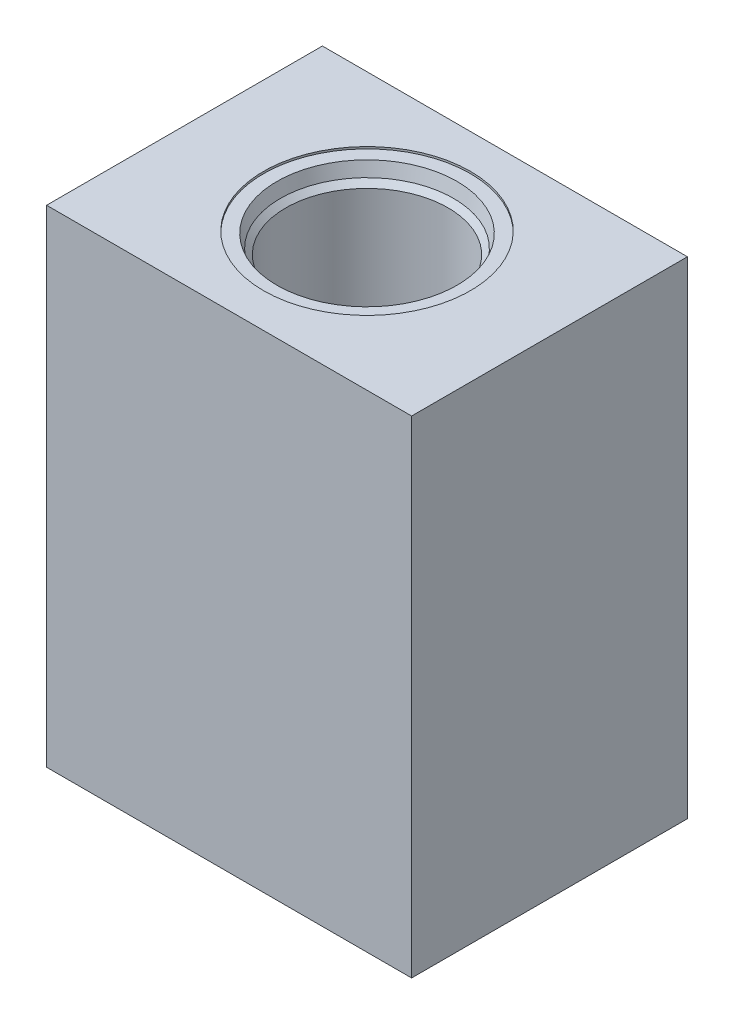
ISO-10303-21;
HEADER;
FILE_DESCRIPTION(('STEP AP214'),'2;1');
FILE_NAME('part.step','',(''),(''),'','','');
FILE_SCHEMA(('AUTOMOTIVE_DESIGN { 1 0 10303 214 1 1 1 1 }'));
ENDSEC;
DATA;
#1=APPLICATION_CONTEXT('core data for automotive mechanical design processes');
#2=APPLICATION_PROTOCOL_DEFINITION('international standard','automotive_design',2000,#1);
#3=PRODUCT_CONTEXT('',#1,'mechanical');
#4=PRODUCT('Part','Part','',(#3));
#5=PRODUCT_RELATED_PRODUCT_CATEGORY('part','',(#4));
#6=PRODUCT_DEFINITION_FORMATION('','',#4);
#7=PRODUCT_DEFINITION_CONTEXT('part definition',#1,'design');
#8=PRODUCT_DEFINITION('design','',#6,#7);
#9=PRODUCT_DEFINITION_SHAPE('','',#8);
#10=(LENGTH_UNIT() NAMED_UNIT(*) SI_UNIT(.MILLI.,.METRE.));
#11=(NAMED_UNIT(*) PLANE_ANGLE_UNIT() SI_UNIT($,.RADIAN.));
#12=(NAMED_UNIT(*) SI_UNIT($,.STERADIAN.) SOLID_ANGLE_UNIT());
#13=UNCERTAINTY_MEASURE_WITH_UNIT(LENGTH_MEASURE(1.E-05),#10,'distance_accuracy_value','');
#14=(GEOMETRIC_REPRESENTATION_CONTEXT(3) GLOBAL_UNCERTAINTY_ASSIGNED_CONTEXT((#13)) GLOBAL_UNIT_ASSIGNED_CONTEXT((#10,
#11,#12)) REPRESENTATION_CONTEXT('',''));
#15=CARTESIAN_POINT('',(0.,0.,0.));
#16=DIRECTION('',(0.,0.,1.));
#17=DIRECTION('',(1.,0.,0.));
#18=AXIS2_PLACEMENT_3D('',#15,#16,#17);
#19=CARTESIAN_POINT('',(-45.,-120.,-34.));
#20=DIRECTION('',(-1.,0.,0.));
#21=DIRECTION('',(0.,0.,1.));
#22=AXIS2_PLACEMENT_3D('',#19,#20,#21);
#23=PLANE('',#22);
#24=DIRECTION('',(0.,0.,1.));
#25=VECTOR('',#24,1.);
#26=CARTESIAN_POINT('',(-45.,0.,-34.));
#27=LINE('',#26,#25);
#28=CARTESIAN_POINT('',(-45.,0.,-34.));
#29=VERTEX_POINT('',#28);
#30=CARTESIAN_POINT('',(-45.,0.,34.));
#31=VERTEX_POINT('',#30);
#32=EDGE_CURVE('E120',#29,#31,#27,.T.);
#33=ORIENTED_EDGE('',*,*,#32,.F.);
#34=DIRECTION('',(0.,1.,0.));
#35=VECTOR('',#34,1.);
#36=CARTESIAN_POINT('',(-45.,-120.,-34.));
#37=LINE('',#36,#35);
#38=CARTESIAN_POINT('',(-45.,-120.,-34.));
#39=VERTEX_POINT('',#38);
#40=EDGE_CURVE('E11',#39,#29,#37,.T.);
#41=ORIENTED_EDGE('',*,*,#40,.F.);
#42=DIRECTION('',(0.,0.,1.));
#43=VECTOR('',#42,1.);
#44=CARTESIAN_POINT('',(-45.,-120.,-34.));
#45=LINE('',#44,#43);
#46=CARTESIAN_POINT('',(-45.,-120.,34.));
#47=VERTEX_POINT('',#46);
#48=EDGE_CURVE('E121',#39,#47,#45,.T.);
#49=ORIENTED_EDGE('',*,*,#48,.T.);
#50=DIRECTION('',(0.,1.,0.));
#51=VECTOR('',#50,1.);
#52=CARTESIAN_POINT('',(-45.,-120.,34.));
#53=LINE('',#52,#51);
#54=EDGE_CURVE('E36',#47,#31,#53,.T.);
#55=ORIENTED_EDGE('',*,*,#54,.T.);
#56=EDGE_LOOP('',(#33,#41,#49,#55));
#57=FACE_BOUND('',#56,.T.);
#58=ADVANCED_FACE('F33',(#57),#23,.T.);
#59=CARTESIAN_POINT('',(-45.,-120.,-34.));
#60=DIRECTION('',(0.,0.,-1.));
#61=DIRECTION('',(-1.,0.,0.));
#62=AXIS2_PLACEMENT_3D('',#59,#60,#61);
#63=PLANE('',#62);
#64=DIRECTION('',(-1.,0.,0.));
#65=VECTOR('',#64,1.);
#66=CARTESIAN_POINT('',(-45.,0.,-34.));
#67=LINE('',#66,#65);
#68=CARTESIAN_POINT('',(45.,0.,-34.));
#69=VERTEX_POINT('',#68);
#70=EDGE_CURVE('E124',#69,#29,#67,.T.);
#71=ORIENTED_EDGE('',*,*,#70,.F.);
#72=DIRECTION('',(0.,1.,0.));
#73=VECTOR('',#72,1.);
#74=CARTESIAN_POINT('',(45.,-120.,-34.));
#75=LINE('',#74,#73);
#76=CARTESIAN_POINT('',(45.,-120.,-34.));
#77=VERTEX_POINT('',#76);
#78=EDGE_CURVE('E42',#77,#69,#75,.T.);
#79=ORIENTED_EDGE('',*,*,#78,.F.);
#80=DIRECTION('',(-1.,0.,0.));
#81=VECTOR('',#80,1.);
#82=CARTESIAN_POINT('',(-45.,-120.,-34.));
#83=LINE('',#82,#81);
#84=EDGE_CURVE('E128',#77,#39,#83,.T.);
#85=ORIENTED_EDGE('',*,*,#84,.T.);
#86=ORIENTED_EDGE('',*,*,#40,.T.);
#87=EDGE_LOOP('',(#71,#79,#85,#86));
#88=FACE_BOUND('',#87,.T.);
#89=ADVANCED_FACE('F143',(#88),#63,.T.);
#90=CARTESIAN_POINT('',(45.,-120.,-34.));
#91=DIRECTION('',(1.,0.,0.));
#92=DIRECTION('',(0.,0.,-1.));
#93=AXIS2_PLACEMENT_3D('',#90,#91,#92);
#94=PLANE('',#93);
#95=DIRECTION('',(0.,0.,-1.));
#96=VECTOR('',#95,1.);
#97=CARTESIAN_POINT('',(45.,0.,-34.));
#98=LINE('',#97,#96);
#99=CARTESIAN_POINT('',(45.,0.,34.));
#100=VERTEX_POINT('',#99);
#101=EDGE_CURVE('E135',#100,#69,#98,.T.);
#102=ORIENTED_EDGE('',*,*,#101,.F.);
#103=DIRECTION('',(0.,1.,0.));
#104=VECTOR('',#103,1.);
#105=CARTESIAN_POINT('',(45.,-120.,34.));
#106=LINE('',#105,#104);
#107=CARTESIAN_POINT('',(45.,-120.,34.));
#108=VERTEX_POINT('',#107);
#109=EDGE_CURVE('E139',#108,#100,#106,.T.);
#110=ORIENTED_EDGE('',*,*,#109,.F.);
#111=DIRECTION('',(0.,0.,-1.));
#112=VECTOR('',#111,1.);
#113=CARTESIAN_POINT('',(45.,-120.,-34.));
#114=LINE('',#113,#112);
#115=EDGE_CURVE('E126',#108,#77,#114,.T.);
#116=ORIENTED_EDGE('',*,*,#115,.T.);
#117=ORIENTED_EDGE('',*,*,#78,.T.);
#118=EDGE_LOOP('',(#102,#110,#116,#117));
#119=FACE_BOUND('',#118,.T.);
#120=ADVANCED_FACE('F146',(#119),#94,.T.);
#121=CARTESIAN_POINT('',(-45.,-120.,34.));
#122=DIRECTION('',(0.,0.,1.));
#123=DIRECTION('',(1.,0.,0.));
#124=AXIS2_PLACEMENT_3D('',#121,#122,#123);
#125=PLANE('',#124);
#126=DIRECTION('',(1.,0.,0.));
#127=VECTOR('',#126,1.);
#128=CARTESIAN_POINT('',(-45.,0.,34.));
#129=LINE('',#128,#127);
#130=EDGE_CURVE('E132',#31,#100,#129,.T.);
#131=ORIENTED_EDGE('',*,*,#130,.F.);
#132=ORIENTED_EDGE('',*,*,#54,.F.);
#133=DIRECTION('',(1.,0.,0.));
#134=VECTOR('',#133,1.);
#135=CARTESIAN_POINT('',(-45.,-120.,34.));
#136=LINE('',#135,#134);
#137=EDGE_CURVE('E123',#47,#108,#136,.T.);
#138=ORIENTED_EDGE('',*,*,#137,.T.);
#139=ORIENTED_EDGE('',*,*,#109,.T.);
#140=EDGE_LOOP('',(#131,#132,#138,#139));
#141=FACE_BOUND('',#140,.T.);
#142=ADVANCED_FACE('F140',(#141),#125,.T.);
#143=CARTESIAN_POINT('',(-45.,-120.,34.));
#144=DIRECTION('',(0.,1.,0.));
#145=DIRECTION('',(0.,0.,1.));
#146=AXIS2_PLACEMENT_3D('',#143,#144,#145);
#147=PLANE('',#146);
#148=ORIENTED_EDGE('',*,*,#48,.F.);
#149=ORIENTED_EDGE('',*,*,#84,.F.);
#150=ORIENTED_EDGE('',*,*,#115,.F.);
#151=ORIENTED_EDGE('',*,*,#137,.F.);
#152=EDGE_LOOP('',(#148,#149,#150,#151));
#153=FACE_BOUND('',#152,.T.);
#154=ADVANCED_FACE('F148',(#153),#147,.F.);
#155=CARTESIAN_POINT('',(-45.,0.,34.));
#156=DIRECTION('',(0.,1.,0.));
#157=DIRECTION('',(0.,0.,1.));
#158=AXIS2_PLACEMENT_3D('',#155,#156,#157);
#159=PLANE('',#158);
#160=CARTESIAN_POINT('',(0.,0.,0.));
#161=DIRECTION('',(0.,1.,0.));
#162=DIRECTION('',(0.,0.,1.));
#163=AXIS2_PLACEMENT_3D('',#160,#161,#162);
#164=CIRCLE('',#163,25.5);
#165=CARTESIAN_POINT('',(0.,0.,25.5));
#166=VERTEX_POINT('',#165);
#167=EDGE_CURVE('E117',#166,#166,#164,.T.);
#168=ORIENTED_EDGE('',*,*,#167,.F.);
#169=EDGE_LOOP('',(#168));
#170=FACE_BOUND('',#169,.T.);
#171=ORIENTED_EDGE('',*,*,#32,.T.);
#172=ORIENTED_EDGE('',*,*,#130,.T.);
#173=ORIENTED_EDGE('',*,*,#101,.T.);
#174=ORIENTED_EDGE('',*,*,#70,.T.);
#175=EDGE_LOOP('',(#171,#172,#173,#174));
#176=FACE_BOUND('',#175,.T.);
#177=ADVANCED_FACE('F142',(#170,#176),#159,.T.);
#178=CARTESIAN_POINT('',(0.,0.,0.));
#179=DIRECTION('',(0.,1.,0.));
#180=DIRECTION('',(0.,0.,1.));
#181=AXIS2_PLACEMENT_3D('',#178,#179,#180);
#182=CYLINDRICAL_SURFACE('',#181,25.5);
#183=CARTESIAN_POINT('',(0.,-0.5,0.));
#184=DIRECTION('',(0.,1.,0.));
#185=DIRECTION('',(0.,0.,1.));
#186=AXIS2_PLACEMENT_3D('',#183,#184,#185);
#187=CIRCLE('',#186,25.5);
#188=CARTESIAN_POINT('',(0.,-0.5,25.5));
#189=VERTEX_POINT('',#188);
#190=EDGE_CURVE('E114',#189,#189,#187,.T.);
#191=ORIENTED_EDGE('',*,*,#190,.F.);
#192=EDGE_LOOP('',(#191));
#193=FACE_BOUND('',#192,.T.);
#194=ORIENTED_EDGE('',*,*,#167,.T.);
#195=EDGE_LOOP('',(#194));
#196=FACE_BOUND('',#195,.T.);
#197=ADVANCED_FACE('F155',(#193,#196),#182,.F.);
#198=CARTESIAN_POINT('',(22.2,-0.5,0.));
#199=DIRECTION('',(0.,-1.,0.));
#200=DIRECTION('',(0.,0.,-1.));
#201=AXIS2_PLACEMENT_3D('',#198,#199,#200);
#202=PLANE('',#201);
#203=CARTESIAN_POINT('',(0.,-0.5,0.));
#204=DIRECTION('',(0.,1.,0.));
#205=DIRECTION('',(0.,0.,1.));
#206=AXIS2_PLACEMENT_3D('',#203,#204,#205);
#207=CIRCLE('',#206,22.2);
#208=CARTESIAN_POINT('',(0.,-0.5,22.2));
#209=VERTEX_POINT('',#208);
#210=EDGE_CURVE('E111',#209,#209,#207,.T.);
#211=ORIENTED_EDGE('',*,*,#210,.F.);
#212=EDGE_LOOP('',(#211));
#213=FACE_BOUND('',#212,.T.);
#214=ORIENTED_EDGE('',*,*,#190,.T.);
#215=EDGE_LOOP('',(#214));
#216=FACE_BOUND('',#215,.T.);
#217=ADVANCED_FACE('F193',(#213,#216),#202,.F.);
#218=CARTESIAN_POINT('',(0.,-0.5,0.));
#219=DIRECTION('',(0.,1.,0.));
#220=DIRECTION('',(0.,0.,1.));
#221=AXIS2_PLACEMENT_3D('',#218,#219,#220);
#222=CONICAL_SURFACE('',#221,22.2,0.261799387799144);
#223=CARTESIAN_POINT('',(0.,-3.7,0.));
#224=DIRECTION('',(0.,1.,0.));
#225=DIRECTION('',(0.,0.,1.));
#226=AXIS2_PLACEMENT_3D('',#223,#224,#225);
#227=CIRCLE('',#226,21.3425625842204);
#228=CARTESIAN_POINT('',(0.,-3.7,21.3425625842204));
#229=VERTEX_POINT('',#228);
#230=EDGE_CURVE('E108',#229,#229,#227,.T.);
#231=ORIENTED_EDGE('',*,*,#230,.F.);
#232=EDGE_LOOP('',(#231));
#233=FACE_BOUND('',#232,.T.);
#234=ORIENTED_EDGE('',*,*,#210,.T.);
#235=EDGE_LOOP('',(#234));
#236=FACE_BOUND('',#235,.T.);
#237=ADVANCED_FACE('F202',(#233,#236),#222,.F.);
#238=CARTESIAN_POINT('',(0.,-3.7,0.));
#239=DIRECTION('',(0.,1.,0.));
#240=DIRECTION('',(0.,0.,1.));
#241=AXIS2_PLACEMENT_3D('',#238,#239,#240);
#242=CONICAL_SURFACE('',#241,21.3425625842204,0.785398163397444);
#243=CARTESIAN_POINT('',(0.,-5.04256258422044,0.));
#244=DIRECTION('',(0.,1.,0.));
#245=DIRECTION('',(0.,0.,1.));
#246=AXIS2_PLACEMENT_3D('',#243,#244,#245);
#247=CIRCLE('',#246,20.);
#248=CARTESIAN_POINT('',(0.,-5.04256258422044,20.));
#249=VERTEX_POINT('',#248);
#250=EDGE_CURVE('E105',#249,#249,#247,.T.);
#251=ORIENTED_EDGE('',*,*,#250,.F.);
#252=EDGE_LOOP('',(#251));
#253=FACE_BOUND('',#252,.T.);
#254=ORIENTED_EDGE('',*,*,#230,.T.);
#255=EDGE_LOOP('',(#254));
#256=FACE_BOUND('',#255,.T.);
#257=ADVANCED_FACE('F212',(#253,#256),#242,.F.);
#258=CARTESIAN_POINT('',(0.,0.,0.));
#259=DIRECTION('',(0.,1.,0.));
#260=DIRECTION('',(0.,0.,1.));
#261=AXIS2_PLACEMENT_3D('',#258,#259,#260);
#262=CYLINDRICAL_SURFACE('',#261,20.);
#263=CARTESIAN_POINT('',(0.,-44.5,0.));
#264=DIRECTION('',(0.,1.,0.));
#265=DIRECTION('',(0.,0.,1.));
#266=AXIS2_PLACEMENT_3D('',#263,#264,#265);
#267=CIRCLE('',#266,20.);
#268=CARTESIAN_POINT('',(0.,-44.5,20.));
#269=VERTEX_POINT('',#268);
#270=EDGE_CURVE('E102',#269,#269,#267,.T.);
#271=ORIENTED_EDGE('',*,*,#270,.F.);
#272=EDGE_LOOP('',(#271));
#273=FACE_BOUND('',#272,.T.);
#274=ORIENTED_EDGE('',*,*,#250,.T.);
#275=EDGE_LOOP('',(#274));
#276=FACE_BOUND('',#275,.T.);
#277=ADVANCED_FACE('F222',(#273,#276),#262,.F.);
#278=CARTESIAN_POINT('',(0.,-44.5,0.));
#279=DIRECTION('',(0.,1.,0.));
#280=DIRECTION('',(0.,0.,1.));
#281=AXIS2_PLACEMENT_3D('',#278,#279,#280);
#282=CONICAL_SURFACE('',#281,20.,0.349065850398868);
#283=CARTESIAN_POINT('',(0.,-49.9949548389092,0.));
#284=DIRECTION('',(0.,1.,0.));
#285=DIRECTION('',(0.,0.,1.));
#286=AXIS2_PLACEMENT_3D('',#283,#284,#285);
#287=CIRCLE('',#286,18.);
#288=CARTESIAN_POINT('',(0.,-49.9949548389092,18.));
#289=VERTEX_POINT('',#288);
#290=EDGE_CURVE('E99',#289,#289,#287,.T.);
#291=ORIENTED_EDGE('',*,*,#290,.F.);
#292=EDGE_LOOP('',(#291));
#293=FACE_BOUND('',#292,.T.);
#294=ORIENTED_EDGE('',*,*,#270,.T.);
#295=EDGE_LOOP('',(#294));
#296=FACE_BOUND('',#295,.T.);
#297=ADVANCED_FACE('F233',(#293,#296),#282,.F.);
#298=CARTESIAN_POINT('',(0.,0.,0.));
#299=DIRECTION('',(0.,1.,0.));
#300=DIRECTION('',(0.,0.,1.));
#301=AXIS2_PLACEMENT_3D('',#298,#299,#300);
#302=CYLINDRICAL_SURFACE('',#301,18.);
#303=CARTESIAN_POINT('',(0.,-60.5,0.));
#304=DIRECTION('',(0.,1.,0.));
#305=DIRECTION('',(0.,0.,1.));
#306=AXIS2_PLACEMENT_3D('',#303,#304,#305);
#307=CIRCLE('',#306,18.);
#308=CARTESIAN_POINT('',(0.,-60.5,18.));
#309=VERTEX_POINT('',#308);
#310=EDGE_CURVE('E94',#309,#309,#307,.T.);
#311=ORIENTED_EDGE('',*,*,#310,.F.);
#312=EDGE_LOOP('',(#311));
#313=FACE_BOUND('',#312,.T.);
#314=ORIENTED_EDGE('',*,*,#290,.T.);
#315=EDGE_LOOP('',(#314));
#316=FACE_BOUND('',#315,.T.);
#317=ADVANCED_FACE('F243',(#313,#316),#302,.F.);
#318=CARTESIAN_POINT('',(0.,-60.5,0.));
#319=DIRECTION('',(0.,1.,0.));
#320=DIRECTION('',(0.,0.,1.));
#321=AXIS2_PLACEMENT_3D('',#318,#319,#320);
#322=CONICAL_SURFACE('',#321,18.,1.02974425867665);
#323=CARTESIAN_POINT('',(0.,-61.7017212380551,0.));
#324=DIRECTION('',(0.,1.,0.));
#325=DIRECTION('',(0.,0.,1.));
#326=AXIS2_PLACEMENT_3D('',#323,#324,#325);
#327=CIRCLE('',#326,16.);
#328=CARTESIAN_POINT('',(0.,-61.7017212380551,16.));
#329=VERTEX_POINT('',#328);
#330=EDGE_CURVE('E91',#329,#329,#327,.T.);
#331=ORIENTED_EDGE('',*,*,#330,.F.);
#332=EDGE_LOOP('',(#331));
#333=FACE_BOUND('',#332,.T.);
#334=ORIENTED_EDGE('',*,*,#310,.T.);
#335=EDGE_LOOP('',(#334));
#336=FACE_BOUND('',#335,.T.);
#337=ADVANCED_FACE('F253',(#333,#336),#322,.F.);
#338=CARTESIAN_POINT('',(0.,0.,0.));
#339=DIRECTION('',(0.,1.,0.));
#340=DIRECTION('',(0.,0.,1.));
#341=AXIS2_PLACEMENT_3D('',#338,#339,#340);
#342=CYLINDRICAL_SURFACE('',#341,16.);
#343=CARTESIAN_POINT('',(0.,-100.,0.));
#344=DIRECTION('',(0.,1.,0.));
#345=DIRECTION('',(0.,0.,1.));
#346=AXIS2_PLACEMENT_3D('',#343,#344,#345);
#347=CIRCLE('',#346,16.);
#348=CARTESIAN_POINT('',(0.,-100.,16.));
#349=VERTEX_POINT('',#348);
#350=EDGE_CURVE('E89',#349,#349,#347,.T.);
#351=ORIENTED_EDGE('',*,*,#350,.F.);
#352=EDGE_LOOP('',(#351));
#353=FACE_BOUND('',#352,.T.);
#354=ORIENTED_EDGE('',*,*,#330,.T.);
#355=EDGE_LOOP('',(#354));
#356=FACE_BOUND('',#355,.T.);
#357=ADVANCED_FACE('F85',(#353,#356),#342,.F.);
#358=CARTESIAN_POINT('',(0.,-100.,0.));
#359=DIRECTION('',(0.,1.,0.));
#360=DIRECTION('',(0.,0.,1.));
#361=AXIS2_PLACEMENT_3D('',#358,#359,#360);
#362=CONICAL_SURFACE('',#361,16.,1.02974425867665);
#363=CARTESIAN_POINT('',(0.,-109.613769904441,0.));
#364=VERTEX_POINT('',#363);
#365=VERTEX_LOOP('',#364);
#366=FACE_BOUND('',#365,.T.);
#367=ORIENTED_EDGE('',*,*,#350,.T.);
#368=EDGE_LOOP('',(#367));
#369=FACE_BOUND('',#368,.T.);
#370=ADVANCED_FACE('F82',(#366,#369),#362,.F.);
#371=CLOSED_SHELL('',(#58,#89,#120,#142,#154,#177,#197,#217,#237,#257,#277,#297,#317,#337,#357,#370));
#372=MANIFOLD_SOLID_BREP('B2',#371);
#373=ADVANCED_BREP_SHAPE_REPRESENTATION('',(#18,#372),#14);
#374=SHAPE_DEFINITION_REPRESENTATION(#9,#373);
ENDSEC;
END-ISO-10303-21;
